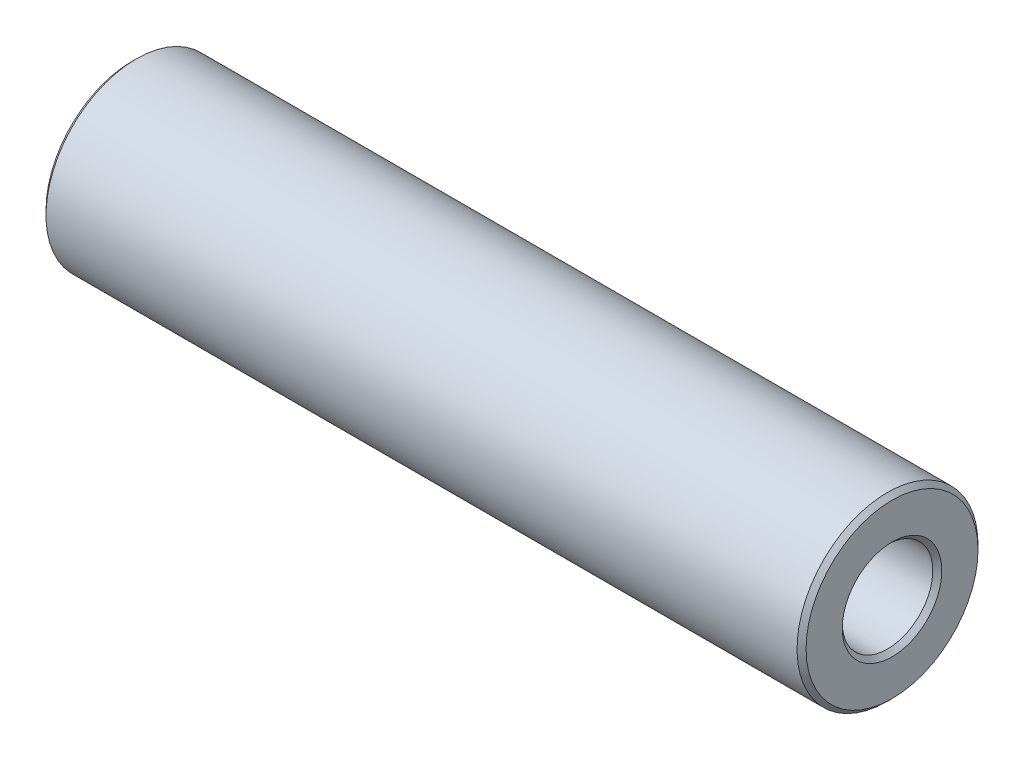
ISO-10303-21;
HEADER;
FILE_DESCRIPTION(('STEP AP214'),'2;1');
FILE_NAME('part.step','',(''),(''),'','','');
FILE_SCHEMA(('AUTOMOTIVE_DESIGN { 1 0 10303 214 1 1 1 1 }'));
ENDSEC;
DATA;
#1=APPLICATION_CONTEXT('core data for automotive mechanical design processes');
#2=APPLICATION_PROTOCOL_DEFINITION('international standard','automotive_design',2000,#1);
#3=PRODUCT_CONTEXT('',#1,'mechanical');
#4=PRODUCT('Part','Part','',(#3));
#5=PRODUCT_RELATED_PRODUCT_CATEGORY('part','',(#4));
#6=PRODUCT_DEFINITION_FORMATION('','',#4);
#7=PRODUCT_DEFINITION_CONTEXT('part definition',#1,'design');
#8=PRODUCT_DEFINITION('design','',#6,#7);
#9=PRODUCT_DEFINITION_SHAPE('','',#8);
#10=(LENGTH_UNIT() NAMED_UNIT(*) SI_UNIT(.MILLI.,.METRE.));
#11=(NAMED_UNIT(*) PLANE_ANGLE_UNIT() SI_UNIT($,.RADIAN.));
#12=(NAMED_UNIT(*) SI_UNIT($,.STERADIAN.) SOLID_ANGLE_UNIT());
#13=UNCERTAINTY_MEASURE_WITH_UNIT(LENGTH_MEASURE(1.E-05),#10,'distance_accuracy_value','');
#14=(GEOMETRIC_REPRESENTATION_CONTEXT(3) GLOBAL_UNCERTAINTY_ASSIGNED_CONTEXT((#13)) GLOBAL_UNIT_ASSIGNED_CONTEXT((#10,
#11,#12)) REPRESENTATION_CONTEXT('',''));
#15=CARTESIAN_POINT('',(0.,0.,0.));
#16=DIRECTION('',(0.,0.,1.));
#17=DIRECTION('',(1.,0.,0.));
#18=AXIS2_PLACEMENT_3D('',#15,#16,#17);
#19=CARTESIAN_POINT('',(24.9999999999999,0.,0.));
#20=DIRECTION('',(1.,0.,0.));
#21=DIRECTION('',(0.,1.,0.));
#22=AXIS2_PLACEMENT_3D('',#19,#20,#21);
#23=PLANE('',#22);
#24=CARTESIAN_POINT('',(24.9999999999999,0.,0.));
#25=DIRECTION('',(1.,0.,0.));
#26=DIRECTION('',(0.,1.,0.));
#27=AXIS2_PLACEMENT_3D('',#24,#25,#26);
#28=CIRCLE('',#27,5.50000000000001);
#29=CARTESIAN_POINT('',(24.9999999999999,5.50000000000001,0.));
#30=VERTEX_POINT('',#29);
#31=EDGE_CURVE('E41',#30,#30,#28,.T.);
#32=ORIENTED_EDGE('',*,*,#31,.T.);
#33=EDGE_LOOP('',(#32));
#34=FACE_BOUND('',#33,.T.);
#35=CARTESIAN_POINT('',(24.9999999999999,0.,0.));
#36=DIRECTION('',(1.,0.,0.));
#37=DIRECTION('',(0.,1.,0.));
#38=AXIS2_PLACEMENT_3D('',#35,#36,#37);
#39=CIRCLE('',#38,9.49999999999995);
#40=CARTESIAN_POINT('',(24.9999999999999,9.49999999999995,0.));
#41=VERTEX_POINT('',#40);
#42=EDGE_CURVE('E45',#41,#41,#39,.F.);
#43=ORIENTED_EDGE('',*,*,#42,.T.);
#44=EDGE_LOOP('',(#43));
#45=FACE_BOUND('',#44,.T.);
#46=ADVANCED_FACE('F30',(#34,#45),#23,.F.);
#47=CARTESIAN_POINT('',(137.284271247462,0.,0.));
#48=DIRECTION('',(-1.,0.,0.));
#49=DIRECTION('',(0.,-1.,0.));
#50=AXIS2_PLACEMENT_3D('',#47,#48,#49);
#51=CYLINDRICAL_SURFACE('',#50,10.);
#52=CARTESIAN_POINT('',(25.4999999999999,0.,0.));
#53=DIRECTION('',(1.,0.,0.));
#54=DIRECTION('',(0.,1.,0.));
#55=AXIS2_PLACEMENT_3D('',#52,#53,#54);
#56=CIRCLE('',#55,10.);
#57=CARTESIAN_POINT('',(25.4999999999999,10.,0.));
#58=VERTEX_POINT('',#57);
#59=EDGE_CURVE('E10',#58,#58,#56,.T.);
#60=ORIENTED_EDGE('',*,*,#59,.T.);
#61=EDGE_LOOP('',(#60));
#62=FACE_BOUND('',#61,.T.);
#63=CARTESIAN_POINT('',(108.5,0.,0.));
#64=DIRECTION('',(-1.,0.,0.));
#65=DIRECTION('',(0.,-1.,0.));
#66=AXIS2_PLACEMENT_3D('',#63,#64,#65);
#67=CIRCLE('',#66,10.);
#68=CARTESIAN_POINT('',(108.5,-9.99999999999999,0.));
#69=VERTEX_POINT('',#68);
#70=EDGE_CURVE('E37',#69,#69,#67,.T.);
#71=ORIENTED_EDGE('',*,*,#70,.T.);
#72=EDGE_LOOP('',(#71));
#73=FACE_BOUND('',#72,.T.);
#74=ADVANCED_FACE('F74',(#62,#73),#51,.T.);
#75=CARTESIAN_POINT('',(137.284271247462,0.,0.));
#76=DIRECTION('',(-1.,0.,0.));
#77=DIRECTION('',(0.,-1.,0.));
#78=AXIS2_PLACEMENT_3D('',#75,#76,#77);
#79=CYLINDRICAL_SURFACE('',#78,5.);
#80=CARTESIAN_POINT('',(108.5,0.,0.));
#81=DIRECTION('',(-1.,0.,0.));
#82=DIRECTION('',(0.,-1.,0.));
#83=AXIS2_PLACEMENT_3D('',#80,#81,#82);
#84=CIRCLE('',#83,5.);
#85=CARTESIAN_POINT('',(108.5,-4.99999999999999,0.));
#86=VERTEX_POINT('',#85);
#87=EDGE_CURVE('E50',#86,#86,#84,.F.);
#88=ORIENTED_EDGE('',*,*,#87,.T.);
#89=EDGE_LOOP('',(#88));
#90=FACE_BOUND('',#89,.T.);
#91=CARTESIAN_POINT('',(25.4999999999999,0.,0.));
#92=DIRECTION('',(1.,0.,0.));
#93=DIRECTION('',(0.,1.,0.));
#94=AXIS2_PLACEMENT_3D('',#91,#92,#93);
#95=CIRCLE('',#94,5.);
#96=CARTESIAN_POINT('',(25.4999999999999,5.,0.));
#97=VERTEX_POINT('',#96);
#98=EDGE_CURVE('E53',#97,#97,#95,.F.);
#99=ORIENTED_EDGE('',*,*,#98,.T.);
#100=EDGE_LOOP('',(#99));
#101=FACE_BOUND('',#100,.T.);
#102=ADVANCED_FACE('F80',(#90,#101),#79,.F.);
#103=CARTESIAN_POINT('',(109.,6.25,0.));
#104=DIRECTION('',(-1.,0.,0.));
#105=DIRECTION('',(0.,0.,1.));
#106=AXIS2_PLACEMENT_3D('',#103,#104,#105);
#107=PLANE('',#106);
#108=CARTESIAN_POINT('',(109.,0.,0.));
#109=DIRECTION('',(-1.,0.,0.));
#110=DIRECTION('',(0.,0.,1.));
#111=AXIS2_PLACEMENT_3D('',#108,#109,#110);
#112=CIRCLE('',#111,5.49999999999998);
#113=CARTESIAN_POINT('',(109.,0.,5.49999999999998));
#114=VERTEX_POINT('',#113);
#115=EDGE_CURVE('E56',#114,#114,#112,.T.);
#116=ORIENTED_EDGE('',*,*,#115,.T.);
#117=EDGE_LOOP('',(#116));
#118=FACE_BOUND('',#117,.T.);
#119=CARTESIAN_POINT('',(109.,0.,0.));
#120=DIRECTION('',(-1.,0.,0.));
#121=DIRECTION('',(0.,0.,1.));
#122=AXIS2_PLACEMENT_3D('',#119,#120,#121);
#123=CIRCLE('',#122,9.49999999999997);
#124=CARTESIAN_POINT('',(109.,0.,9.49999999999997));
#125=VERTEX_POINT('',#124);
#126=EDGE_CURVE('E59',#125,#125,#123,.F.);
#127=ORIENTED_EDGE('',*,*,#126,.T.);
#128=EDGE_LOOP('',(#127));
#129=FACE_BOUND('',#128,.T.);
#130=ADVANCED_FACE('F63',(#118,#129),#107,.F.);
#131=CARTESIAN_POINT('',(109.,0.,0.));
#132=DIRECTION('',(1.,0.,0.));
#133=DIRECTION('',(0.,1.,0.));
#134=AXIS2_PLACEMENT_3D('',#131,#132,#133);
#135=CONICAL_SURFACE('',#134,5.49999999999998,0.785398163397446);
#136=ORIENTED_EDGE('',*,*,#87,.F.);
#137=EDGE_LOOP('',(#136));
#138=FACE_BOUND('',#137,.T.);
#139=ORIENTED_EDGE('',*,*,#115,.F.);
#140=EDGE_LOOP('',(#139));
#141=FACE_BOUND('',#140,.T.);
#142=ADVANCED_FACE('F89',(#138,#141),#135,.F.);
#143=CARTESIAN_POINT('',(24.9999999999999,0.,0.));
#144=DIRECTION('',(-1.,0.,0.));
#145=DIRECTION('',(0.,-1.,0.));
#146=AXIS2_PLACEMENT_3D('',#143,#144,#145);
#147=CONICAL_SURFACE('',#146,5.50000000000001,0.785398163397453);
#148=ORIENTED_EDGE('',*,*,#98,.F.);
#149=EDGE_LOOP('',(#148));
#150=FACE_BOUND('',#149,.T.);
#151=ORIENTED_EDGE('',*,*,#31,.F.);
#152=EDGE_LOOP('',(#151));
#153=FACE_BOUND('',#152,.T.);
#154=ADVANCED_FACE('F71',(#150,#153),#147,.F.);
#155=CARTESIAN_POINT('',(25.4999999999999,0.,0.));
#156=DIRECTION('',(1.,0.,0.));
#157=DIRECTION('',(0.,1.,0.));
#158=AXIS2_PLACEMENT_3D('',#155,#156,#157);
#159=CONICAL_SURFACE('',#158,10.,0.78539816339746);
#160=ORIENTED_EDGE('',*,*,#42,.F.);
#161=EDGE_LOOP('',(#160));
#162=FACE_BOUND('',#161,.T.);
#163=ORIENTED_EDGE('',*,*,#59,.F.);
#164=EDGE_LOOP('',(#163));
#165=FACE_BOUND('',#164,.T.);
#166=ADVANCED_FACE('F67',(#162,#165),#159,.T.);
#167=CARTESIAN_POINT('',(108.5,0.,0.));
#168=DIRECTION('',(-1.,0.,0.));
#169=DIRECTION('',(0.,-1.,0.));
#170=AXIS2_PLACEMENT_3D('',#167,#168,#169);
#171=CONICAL_SURFACE('',#170,10.,0.78539816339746);
#172=ORIENTED_EDGE('',*,*,#126,.F.);
#173=EDGE_LOOP('',(#172));
#174=FACE_BOUND('',#173,.T.);
#175=ORIENTED_EDGE('',*,*,#70,.F.);
#176=EDGE_LOOP('',(#175));
#177=FACE_BOUND('',#176,.T.);
#178=ADVANCED_FACE('F32',(#174,#177),#171,.T.);
#179=CLOSED_SHELL('',(#46,#74,#102,#130,#142,#154,#166,#178));
#180=MANIFOLD_SOLID_BREP('B2',#179);
#181=ADVANCED_BREP_SHAPE_REPRESENTATION('',(#18,#180),#14);
#182=SHAPE_DEFINITION_REPRESENTATION(#9,#181);
ENDSEC;
END-ISO-10303-21;
